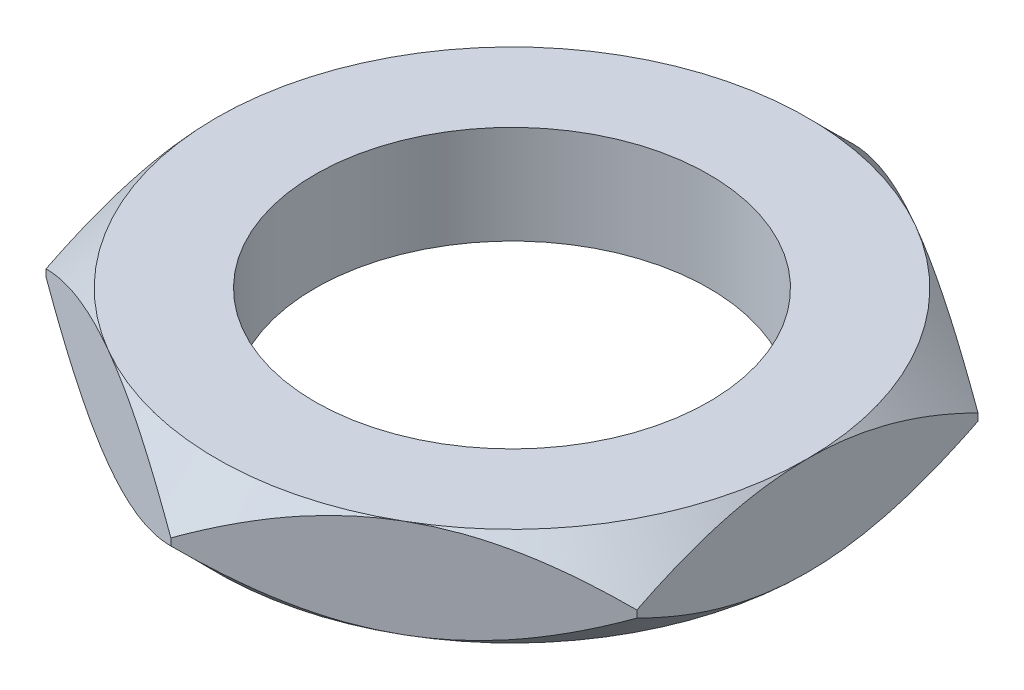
ISO-10303-21;
HEADER;
FILE_DESCRIPTION(('STEP AP214'),'2;1');
FILE_NAME('part.step','',(''),(''),'','','');
FILE_SCHEMA(('AUTOMOTIVE_DESIGN { 1 0 10303 214 1 1 1 1 }'));
ENDSEC;
DATA;
#1=APPLICATION_CONTEXT('core data for automotive mechanical design processes');
#2=APPLICATION_PROTOCOL_DEFINITION('international standard','automotive_design',2000,#1);
#3=PRODUCT_CONTEXT('',#1,'mechanical');
#4=PRODUCT('Part','Part','',(#3));
#5=PRODUCT_RELATED_PRODUCT_CATEGORY('part','',(#4));
#6=PRODUCT_DEFINITION_FORMATION('','',#4);
#7=PRODUCT_DEFINITION_CONTEXT('part definition',#1,'design');
#8=PRODUCT_DEFINITION('design','',#6,#7);
#9=PRODUCT_DEFINITION_SHAPE('','',#8);
#10=(LENGTH_UNIT() NAMED_UNIT(*) SI_UNIT(.MILLI.,.METRE.));
#11=(NAMED_UNIT(*) PLANE_ANGLE_UNIT() SI_UNIT($,.RADIAN.));
#12=(NAMED_UNIT(*) SI_UNIT($,.STERADIAN.) SOLID_ANGLE_UNIT());
#13=UNCERTAINTY_MEASURE_WITH_UNIT(LENGTH_MEASURE(1.E-05),#10,'distance_accuracy_value','');
#14=(GEOMETRIC_REPRESENTATION_CONTEXT(3) GLOBAL_UNCERTAINTY_ASSIGNED_CONTEXT((#13)) GLOBAL_UNIT_ASSIGNED_CONTEXT((#10,
#11,#12)) REPRESENTATION_CONTEXT('',''));
#15=CARTESIAN_POINT('',(0.,0.,0.));
#16=DIRECTION('',(0.,0.,1.));
#17=DIRECTION('',(1.,0.,0.));
#18=AXIS2_PLACEMENT_3D('',#15,#16,#17);
#19=CARTESIAN_POINT('',(4.49999999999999,1.5,-2.59807621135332));
#20=DIRECTION('',(-0.5,0.,0.866025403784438));
#21=DIRECTION('',(0.866025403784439,0.,0.5));
#22=AXIS2_PLACEMENT_3D('',#19,#20,#21);
#23=PLANE('',#22);
#24=CARTESIAN_POINT('',(-0.000200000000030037,0.69626789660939,-5.19626789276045));
#25=CARTESIAN_POINT('',(0.0771760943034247,0.651598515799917,-5.15159478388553));
#26=CARTESIAN_POINT('',(0.155146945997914,0.608299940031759,-5.10657829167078));
#27=CARTESIAN_POINT('',(0.31239485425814,0.52486140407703,-5.01579116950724));
#28=CARTESIAN_POINT('',(0.391672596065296,0.484723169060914,-4.97002014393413));
#29=CARTESIAN_POINT('',(0.632377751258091,0.369332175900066,-4.83104895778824));
#30=CARTESIAN_POINT('',(0.795842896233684,0.299595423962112,-4.73667231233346));
#31=CARTESIAN_POINT('',(1.12548346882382,0.180175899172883,-4.54635423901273));
#32=CARTESIAN_POINT('',(1.29157463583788,0.130192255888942,-4.45046145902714));
#33=CARTESIAN_POINT('',(1.54344209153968,0.0723733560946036,-4.30504571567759));
#34=CARTESIAN_POINT('',(1.62776873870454,0.0559675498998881,-4.25635970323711));
#35=CARTESIAN_POINT('',(1.79713606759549,0.0292460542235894,-4.15857543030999));
#36=CARTESIAN_POINT('',(1.88217664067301,0.0189294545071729,-4.10947723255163));
#37=CARTESIAN_POINT('',(2.08940607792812,0.00163236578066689,-3.98983326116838));
#38=CARTESIAN_POINT('',(2.21181821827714,-0.00199708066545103,-3.9191585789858));
#39=CARTESIAN_POINT('',(2.4564218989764,0.00409348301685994,-3.77793657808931));
#40=CARTESIAN_POINT('',(2.57861334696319,0.0138181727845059,-3.70738931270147));
#41=CARTESIAN_POINT('',(2.8218442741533,0.0460437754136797,-3.56695987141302));
#42=CARTESIAN_POINT('',(2.9428823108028,0.0685589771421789,-3.49707852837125));
#43=CARTESIAN_POINT('',(3.18287804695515,0.125141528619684,-3.35851692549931));
#44=CARTESIAN_POINT('',(3.30183590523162,0.159207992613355,-3.28983657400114));
#45=CARTESIAN_POINT('',(3.51301267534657,0.229295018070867,-3.16791360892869));
#46=CARTESIAN_POINT('',(3.60569909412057,0.263472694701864,-3.11440108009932));
#47=CARTESIAN_POINT('',(3.78940800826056,0.337335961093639,-3.00833668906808));
#48=CARTESIAN_POINT('',(3.88043045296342,0.37702171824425,-2.95578485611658));
#49=CARTESIAN_POINT('',(4.06052473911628,0.461011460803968,-2.85180737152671));
#50=CARTESIAN_POINT('',(4.14960170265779,0.505300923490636,-2.80037876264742));
#51=CARTESIAN_POINT('',(4.32610607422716,0.597916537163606,-2.6984739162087));
#52=CARTESIAN_POINT('',(4.41353445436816,0.646240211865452,-2.64799711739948));
#53=CARTESIAN_POINT('',(4.50019999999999,0.696267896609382,-2.59796074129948));
#54=B_SPLINE_CURVE_WITH_KNOTS('',3,(#24,#25,#26,#27,#28,#29,#30,#31,#32,#33,#34,#35,#36,#37,#38,
#39,#40,#41,#42,#43,#44,#45,#46,#47,#48,#49,#50,#51,#52,#53),.UNSPECIFIED.,.F.,.F.,(4,2,2,2,2,2,
2,2,2,2,2,2,2,2,4),(0.,0.299653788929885,0.599470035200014,1.20233965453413,1.79563573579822,
2.09170187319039,2.38772374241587,2.81125251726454,3.23492974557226,3.65908121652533,
4.08320017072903,4.42009140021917,4.75699287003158,5.09286208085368,5.42852662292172),.UNSPECIFIED.);
#55=CARTESIAN_POINT('',(0.,0.696152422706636,-5.19615242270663));
#56=VERTEX_POINT('',#55);
#57=CARTESIAN_POINT('',(2.24999999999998,0.,-3.89711431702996));
#58=VERTEX_POINT('',#57);
#59=EDGE_CURVE('E150',#56,#58,#54,.T.);
#60=ORIENTED_EDGE('',*,*,#59,.F.);
#61=DIRECTION('',(0.,-1.,0.));
#62=VECTOR('',#61,1.);
#63=CARTESIAN_POINT('',(0.,1.5,-5.19615242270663));
#64=LINE('',#63,#62);
#65=CARTESIAN_POINT('',(0.,0.803847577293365,-5.19615242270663));
#66=VERTEX_POINT('',#65);
#67=EDGE_CURVE('E245',#66,#56,#64,.T.);
#68=ORIENTED_EDGE('',*,*,#67,.F.);
#69=CARTESIAN_POINT('',(4.50019999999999,0.803732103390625,-2.59796074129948));
#70=CARTESIAN_POINT('',(4.42282390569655,0.848401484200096,-2.64263385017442));
#71=CARTESIAN_POINT('',(4.34485305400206,0.891700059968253,-2.68765034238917));
#72=CARTESIAN_POINT('',(4.18760514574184,0.975138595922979,-2.77843746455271));
#73=CARTESIAN_POINT('',(4.10832740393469,1.01527683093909,-2.82420849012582));
#74=CARTESIAN_POINT('',(3.8676222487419,1.13066782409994,-2.96317967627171));
#75=CARTESIAN_POINT('',(3.70415710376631,1.20040457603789,-3.05755632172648));
#76=CARTESIAN_POINT('',(3.37451653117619,1.31982410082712,-3.24787439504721));
#77=CARTESIAN_POINT('',(3.20842536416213,1.36980774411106,-3.3437671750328));
#78=CARTESIAN_POINT('',(2.95655790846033,1.42762664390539,-3.48918291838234));
#79=CARTESIAN_POINT('',(2.87223126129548,1.44403245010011,-3.53786893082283));
#80=CARTESIAN_POINT('',(2.70286393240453,1.47075394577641,-3.63565320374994));
#81=CARTESIAN_POINT('',(2.61782335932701,1.48107054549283,-3.68475140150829));
#82=CARTESIAN_POINT('',(2.41059392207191,1.49836763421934,-3.80439537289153));
#83=CARTESIAN_POINT('',(2.28818178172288,1.50199708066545,-3.87507005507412));
#84=CARTESIAN_POINT('',(2.04357810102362,1.49590651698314,-4.01629205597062));
#85=CARTESIAN_POINT('',(1.92138665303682,1.4861818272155,-4.08683932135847));
#86=CARTESIAN_POINT('',(1.67815572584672,1.45395622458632,-4.22726876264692));
#87=CARTESIAN_POINT('',(1.55711768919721,1.43144102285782,-4.2971501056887));
#88=CARTESIAN_POINT('',(1.31712195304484,1.37485847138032,-4.43571170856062));
#89=CARTESIAN_POINT('',(1.19816409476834,1.34079200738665,-4.50439206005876));
#90=CARTESIAN_POINT('',(0.986987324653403,1.27070498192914,-4.62631502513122));
#91=CARTESIAN_POINT('',(0.894300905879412,1.23652730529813,-4.67982755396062));
#92=CARTESIAN_POINT('',(0.710591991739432,1.16266403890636,-4.78589194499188));
#93=CARTESIAN_POINT('',(0.619569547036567,1.12297828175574,-4.83844377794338));
#94=CARTESIAN_POINT('',(0.439475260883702,1.03898853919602,-4.94242126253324));
#95=CARTESIAN_POINT('',(0.350398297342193,0.994699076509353,-4.99384987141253));
#96=CARTESIAN_POINT('',(0.173893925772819,0.902083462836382,-5.09575471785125));
#97=CARTESIAN_POINT('',(0.0864655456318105,0.853759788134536,-5.14623151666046));
#98=CARTESIAN_POINT('',(-0.000200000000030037,0.803732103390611,-5.19626789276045));
#99=B_SPLINE_CURVE_WITH_KNOTS('',3,(#69,#70,#71,#72,#73,#74,#75,#76,#77,#78,#79,#80,#81,#82,#83,
#84,#85,#86,#87,#88,#89,#90,#91,#92,#93,#94,#95,#96,#97,#98),.UNSPECIFIED.,.F.,.F.,(4,2,2,2,2,2,
2,2,2,2,2,2,2,2,4),(0.,0.299653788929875,0.599470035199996,1.2023396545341,1.79563573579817,
2.09170187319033,2.38772374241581,2.81125251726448,3.23492974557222,3.65908121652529,
4.083200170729,4.42009140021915,4.75699287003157,5.09286208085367,5.42852662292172),.UNSPECIFIED.);
#100=CARTESIAN_POINT('',(2.24999999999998,1.5,-3.89711431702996));
#101=VERTEX_POINT('',#100);
#102=EDGE_CURVE('E221',#101,#66,#99,.T.);
#103=ORIENTED_EDGE('',*,*,#102,.F.);
#104=CARTESIAN_POINT('',(4.49999999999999,0.803847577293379,-2.59807621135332));
#105=VERTEX_POINT('',#104);
#106=EDGE_CURVE('E226',#105,#101,#99,.T.);
#107=ORIENTED_EDGE('',*,*,#106,.F.);
#108=DIRECTION('',(0.,-1.,0.));
#109=VECTOR('',#108,1.);
#110=CARTESIAN_POINT('',(4.49999999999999,1.5,-2.59807621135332));
#111=LINE('',#110,#109);
#112=CARTESIAN_POINT('',(4.49999999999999,0.696152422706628,-2.59807621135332));
#113=VERTEX_POINT('',#112);
#114=EDGE_CURVE('E233',#105,#113,#111,.T.);
#115=ORIENTED_EDGE('',*,*,#114,.T.);
#116=EDGE_CURVE('E131',#58,#113,#54,.T.);
#117=ORIENTED_EDGE('',*,*,#116,.F.);
#118=EDGE_LOOP('',(#60,#68,#103,#107,#115,#117));
#119=FACE_BOUND('',#118,.T.);
#120=ADVANCED_FACE('F34',(#119),#23,.F.);
#121=CARTESIAN_POINT('',(0.,1.5,-5.19615242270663));
#122=DIRECTION('',(0.5,0.,0.866025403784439));
#123=DIRECTION('',(0.866025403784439,0.,-0.5));
#124=AXIS2_PLACEMENT_3D('',#121,#122,#123);
#125=PLANE('',#124);
#126=CARTESIAN_POINT('',(-4.50019999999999,0.696267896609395,-2.59796074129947));
#127=CARTESIAN_POINT('',(-4.42282390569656,0.65159851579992,-2.64263385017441));
#128=CARTESIAN_POINT('',(-4.34485305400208,0.608299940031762,-2.68765034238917));
#129=CARTESIAN_POINT('',(-4.18760514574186,0.524861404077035,-2.77843746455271));
#130=CARTESIAN_POINT('',(-4.10832740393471,0.484723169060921,-2.82420849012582));
#131=CARTESIAN_POINT('',(-3.86762224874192,0.369332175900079,-2.9631796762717));
#132=CARTESIAN_POINT('',(-3.70415710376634,0.299595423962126,-3.05755632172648));
#133=CARTESIAN_POINT('',(-3.37451653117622,0.180175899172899,-3.24787439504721));
#134=CARTESIAN_POINT('',(-3.20842536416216,0.13019225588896,-3.34376717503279));
#135=CARTESIAN_POINT('',(-2.95655790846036,0.0723733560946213,-3.48918291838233));
#136=CARTESIAN_POINT('',(-2.87223126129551,0.0559675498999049,-3.53786893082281));
#137=CARTESIAN_POINT('',(-2.70286393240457,0.0292460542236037,-3.63565320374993));
#138=CARTESIAN_POINT('',(-2.61782335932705,0.0189294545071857,-3.68475140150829));
#139=CARTESIAN_POINT('',(-2.41059392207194,0.00163236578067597,-3.80439537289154));
#140=CARTESIAN_POINT('',(-2.28818178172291,-0.0019970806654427,-3.87507005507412));
#141=CARTESIAN_POINT('',(-2.04357810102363,0.00409348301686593,-4.01629205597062));
#142=CARTESIAN_POINT('',(-1.92138665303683,0.0138181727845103,-4.08683932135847));
#143=CARTESIAN_POINT('',(-1.67815572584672,0.0460437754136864,-4.22726876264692));
#144=CARTESIAN_POINT('',(-1.55711768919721,0.0685589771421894,-4.2971501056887));
#145=CARTESIAN_POINT('',(-1.31712195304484,0.125141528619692,-4.43571170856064));
#146=CARTESIAN_POINT('',(-1.19816409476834,0.159207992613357,-4.5043920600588));
#147=CARTESIAN_POINT('',(-0.986987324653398,0.229295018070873,-4.62631502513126));
#148=CARTESIAN_POINT('',(-0.894300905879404,0.263472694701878,-4.67982755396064));
#149=CARTESIAN_POINT('',(-0.710591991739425,0.337335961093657,-4.78589194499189));
#150=CARTESIAN_POINT('',(-0.619569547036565,0.377021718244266,-4.83844377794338));
#151=CARTESIAN_POINT('',(-0.439475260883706,0.461011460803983,-4.94242126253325));
#152=CARTESIAN_POINT('',(-0.350398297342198,0.505300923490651,-4.99384987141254));
#153=CARTESIAN_POINT('',(-0.173893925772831,0.59791653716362,-5.09575471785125));
#154=CARTESIAN_POINT('',(-0.0864655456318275,0.646240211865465,-5.14623151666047));
#155=CARTESIAN_POINT('',(0.000200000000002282,0.69626789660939,-5.19626789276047));
#156=B_SPLINE_CURVE_WITH_KNOTS('',3,(#126,#127,#128,#129,#130,#131,#132,#133,#134,#135,#136,
#137,#138,#139,#140,#141,#142,#143,#144,#145,#146,#147,#148,#149,#150,#151,#152,#153,#154,#155),
.UNSPECIFIED.,.F.,.F.,(4,2,2,2,2,2,2,2,2,2,2,2,2,2,4),(0.,0.299653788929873,0.59947003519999,
1.20233965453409,1.79563573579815,2.09170187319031,2.38772374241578,2.81125251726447,
3.23492974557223,3.65908121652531,4.08320017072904,4.42009140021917,4.75699287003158,
5.09286208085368,5.42852662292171),.UNSPECIFIED.);
#157=CARTESIAN_POINT('',(-4.50000000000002,0.696152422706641,-2.59807621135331));
#158=VERTEX_POINT('',#157);
#159=CARTESIAN_POINT('',(-2.25,0.,-3.89711431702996));
#160=VERTEX_POINT('',#159);
#161=EDGE_CURVE('E193',#158,#160,#156,.T.);
#162=ORIENTED_EDGE('',*,*,#161,.F.);
#163=DIRECTION('',(0.,-1.,0.));
#164=VECTOR('',#163,1.);
#165=CARTESIAN_POINT('',(-4.50000000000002,1.5,-2.59807621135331));
#166=LINE('',#165,#164);
#167=CARTESIAN_POINT('',(-4.50000000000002,0.803847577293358,-2.59807621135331));
#168=VERTEX_POINT('',#167);
#169=EDGE_CURVE('E242',#168,#158,#166,.T.);
#170=ORIENTED_EDGE('',*,*,#169,.F.);
#171=CARTESIAN_POINT('',(0.000200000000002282,0.80373210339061,-5.19626789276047));
#172=CARTESIAN_POINT('',(-0.0771760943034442,0.848401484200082,-5.15159478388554));
#173=CARTESIAN_POINT('',(-0.155146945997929,0.89170005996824,-5.10657829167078));
#174=CARTESIAN_POINT('',(-0.31239485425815,0.975138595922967,-5.01579116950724));
#175=CARTESIAN_POINT('',(-0.391672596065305,1.01527683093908,-4.97002014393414));
#176=CARTESIAN_POINT('',(-0.632377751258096,1.13066782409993,-4.83104895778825));
#177=CARTESIAN_POINT('',(-0.795842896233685,1.20040457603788,-4.73667231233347));
#178=CARTESIAN_POINT('',(-1.12548346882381,1.31982410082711,-4.54635423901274));
#179=CARTESIAN_POINT('',(-1.29157463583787,1.36980774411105,-4.45046145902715));
#180=CARTESIAN_POINT('',(-1.54344209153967,1.42762664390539,-4.30504571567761));
#181=CARTESIAN_POINT('',(-1.62776873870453,1.4440324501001,-4.25635970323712));
#182=CARTESIAN_POINT('',(-1.79713606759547,1.4707539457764,-4.15857543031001));
#183=CARTESIAN_POINT('',(-1.882176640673,1.48107054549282,-4.10947723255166));
#184=CARTESIAN_POINT('',(-2.08940607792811,1.49836763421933,-3.98983326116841));
#185=CARTESIAN_POINT('',(-2.21181821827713,1.50199708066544,-3.91915857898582));
#186=CARTESIAN_POINT('',(-2.4564218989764,1.49590651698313,-3.77793657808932));
#187=CARTESIAN_POINT('',(-2.5786133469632,1.48618182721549,-3.70738931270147));
#188=CARTESIAN_POINT('',(-2.82184427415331,1.45395622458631,-3.56695987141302));
#189=CARTESIAN_POINT('',(-2.94288231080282,1.43144102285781,-3.49707852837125));
#190=CARTESIAN_POINT('',(-3.18287804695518,1.3748584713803,-3.35851692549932));
#191=CARTESIAN_POINT('',(-3.30183590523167,1.34079200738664,-3.28983657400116));
#192=CARTESIAN_POINT('',(-3.51301267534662,1.27070498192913,-3.16791360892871));
#193=CARTESIAN_POINT('',(-3.60569909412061,1.23652730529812,-3.11440108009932));
#194=CARTESIAN_POINT('',(-3.78940800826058,1.16266403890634,-3.00833668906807));
#195=CARTESIAN_POINT('',(-3.88043045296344,1.12297828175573,-2.95578485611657));
#196=CARTESIAN_POINT('',(-4.0605247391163,1.03898853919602,-2.85180737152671));
#197=CARTESIAN_POINT('',(-4.14960170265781,0.994699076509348,-2.80037876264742));
#198=CARTESIAN_POINT('',(-4.32610607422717,0.902083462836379,-2.6984739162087));
#199=CARTESIAN_POINT('',(-4.41353445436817,0.853759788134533,-2.64799711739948));
#200=CARTESIAN_POINT('',(-4.50019999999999,0.803732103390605,-2.59796074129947));
#201=B_SPLINE_CURVE_WITH_KNOTS('',3,(#171,#172,#173,#174,#175,#176,#177,#178,#179,#180,#181,
#182,#183,#184,#185,#186,#187,#188,#189,#190,#191,#192,#193,#194,#195,#196,#197,#198,#199,#200),
.UNSPECIFIED.,.F.,.F.,(4,2,2,2,2,2,2,2,2,2,2,2,2,2,4),(0.,0.299653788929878,0.599470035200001,
1.20233965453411,1.79563573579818,2.09170187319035,2.38772374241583,2.81125251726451,
3.23492974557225,3.65908121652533,4.08320017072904,4.42009140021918,4.75699287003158,
5.09286208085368,5.42852662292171),.UNSPECIFIED.);
#202=CARTESIAN_POINT('',(-2.25000000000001,1.5,-3.89711431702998));
#203=VERTEX_POINT('',#202);
#204=EDGE_CURVE('E208',#203,#168,#201,.T.);
#205=ORIENTED_EDGE('',*,*,#204,.F.);
#206=EDGE_CURVE('E214',#66,#203,#201,.T.);
#207=ORIENTED_EDGE('',*,*,#206,.F.);
#208=ORIENTED_EDGE('',*,*,#67,.T.);
#209=EDGE_CURVE('E151',#160,#56,#156,.T.);
#210=ORIENTED_EDGE('',*,*,#209,.F.);
#211=EDGE_LOOP('',(#162,#170,#205,#207,#208,#210));
#212=FACE_BOUND('',#211,.T.);
#213=ADVANCED_FACE('F200',(#212),#125,.F.);
#214=CARTESIAN_POINT('',(-4.50000000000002,1.5,-2.59807621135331));
#215=DIRECTION('',(1.,0.,0.));
#216=DIRECTION('',(0.,0.,-1.));
#217=AXIS2_PLACEMENT_3D('',#214,#215,#216);
#218=PLANE('',#217);
#219=CARTESIAN_POINT('',(-4.50000000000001,3.46036408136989,-6.56638380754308));
#220=CARTESIAN_POINT('',(-4.50000000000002,3.32407212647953,-6.40111667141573));
#221=CARTESIAN_POINT('',(-4.50000000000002,3.18871360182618,-6.23506760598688));
#222=CARTESIAN_POINT('',(-4.50000000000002,2.92036250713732,-5.90100181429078));
#223=CARTESIAN_POINT('',(-4.50000000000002,2.78737054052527,-5.73298460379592));
#224=CARTESIAN_POINT('',(-4.50000000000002,2.52286788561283,-5.39279287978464));
#225=CARTESIAN_POINT('',(-4.50000000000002,2.39138978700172,-5.22059294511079));
#226=CARTESIAN_POINT('',(-4.50000000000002,2.13222901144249,-4.87337879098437));
#227=CARTESIAN_POINT('',(-4.50000000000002,2.00454596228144,-4.69836485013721));
#228=CARTESIAN_POINT('',(-4.50000000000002,1.74186715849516,-4.32777489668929));
#229=CARTESIAN_POINT('',(-4.50000000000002,1.60736146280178,-4.13184955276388));
#230=CARTESIAN_POINT('',(-4.50000000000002,1.34605070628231,-3.73479283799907));
#231=CARTESIAN_POINT('',(-4.50000000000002,1.21924825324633,-3.53365973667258));
#232=CARTESIAN_POINT('',(-4.50000000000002,0.976783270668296,-3.12600408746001));
#233=CARTESIAN_POINT('',(-4.50000000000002,0.861071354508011,-2.9195111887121));
#234=CARTESIAN_POINT('',(-4.50000000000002,0.644220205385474,-2.49908187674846));
#235=CARTESIAN_POINT('',(-4.50000000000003,0.543068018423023,-2.28515229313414));
#236=CARTESIAN_POINT('',(-4.50000000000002,0.387940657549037,-1.91347041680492));
#237=CARTESIAN_POINT('',(-4.50000000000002,0.328868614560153,-1.75786085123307));
#238=CARTESIAN_POINT('',(-4.50000000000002,0.223173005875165,-1.44237337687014));
#239=CARTESIAN_POINT('',(-4.50000000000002,0.176551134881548,-1.28249489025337));
#240=CARTESIAN_POINT('',(-4.50000000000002,0.0992715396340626,-0.962700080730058));
#241=CARTESIAN_POINT('',(-4.50000000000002,0.068275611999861,-0.802866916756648));
#242=CARTESIAN_POINT('',(-4.50000000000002,0.0228151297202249,-0.480850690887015));
#243=CARTESIAN_POINT('',(-4.50000000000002,0.00834644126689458,-0.318668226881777));
#244=CARTESIAN_POINT('',(-4.50000000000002,-0.00261949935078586,-0.00257242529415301));
#245=CARTESIAN_POINT('',(-4.50000000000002,-5.586362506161E-05,0.151308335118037));
#246=CARTESIAN_POINT('',(-4.50000000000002,0.0206581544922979,0.458007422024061));
#247=CARTESIAN_POINT('',(-4.50000000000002,0.0388095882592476,0.610825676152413));
#248=CARTESIAN_POINT('',(-4.50000000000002,0.0899440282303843,0.916967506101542));
#249=CARTESIAN_POINT('',(-4.50000000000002,0.123208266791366,1.07024324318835));
#250=CARTESIAN_POINT('',(-4.50000000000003,0.202625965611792,1.37335740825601));
#251=CARTESIAN_POINT('',(-4.50000000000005,0.248779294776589,1.52319587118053));
#252=CARTESIAN_POINT('',(-4.50000000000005,0.352721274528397,1.82177349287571));
#253=CARTESIAN_POINT('',(-4.50000000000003,0.410705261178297,1.97044375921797));
#254=CARTESIAN_POINT('',(-4.50000000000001,0.535671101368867,2.26398687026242));
#255=CARTESIAN_POINT('',(-4.50000000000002,0.602656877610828,2.40885802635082));
#256=CARTESIAN_POINT('',(-4.50000000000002,0.74403938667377,2.69546599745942));
#257=CARTESIAN_POINT('',(-4.50000000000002,0.818458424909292,2.83719171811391));
#258=CARTESIAN_POINT('',(-4.50000000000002,0.973076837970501,3.11740594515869));
#259=CARTESIAN_POINT('',(-4.50000000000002,1.0532753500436,3.25589493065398));
#260=CARTESIAN_POINT('',(-4.50000000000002,1.21425040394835,3.52327657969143));
#261=CARTESIAN_POINT('',(-4.50000000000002,1.29480234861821,3.65230518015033));
#262=CARTESIAN_POINT('',(-4.50000000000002,1.45936331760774,3.90814523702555));
#263=CARTESIAN_POINT('',(-4.50000000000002,1.54337259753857,4.03495652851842));
#264=CARTESIAN_POINT('',(-4.50000000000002,1.71355874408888,4.28564238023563));
#265=CARTESIAN_POINT('',(-4.50000000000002,1.79971313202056,4.40953225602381));
#266=CARTESIAN_POINT('',(-4.50000000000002,1.97435335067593,4.65560836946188));
#267=CARTESIAN_POINT('',(-4.50000000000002,2.0628385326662,4.77779506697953));
#268=CARTESIAN_POINT('',(-4.50000000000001,2.15227861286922,4.89926634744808));
#269=B_SPLINE_CURVE_WITH_KNOTS('',3,(#219,#220,#221,#222,#223,#224,#225,#226,#227,#228,#229,
#230,#231,#232,#233,#234,#235,#236,#237,#238,#239,#240,#241,#242,#243,#244,#245,#246,#247,#248,
#249,#250,#251,#252,#253,#254,#255,#256,#257,#258,#259,#260,#261,#262,#263,#264,#265,#266,#267,
#268),.UNSPECIFIED.,.F.,.F.,(4,2,2,2,2,2,2,2,2,2,2,2,2,2,2,2,2,2,2,2,2,2,2,2,4),(0.,
0.642660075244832,1.2854817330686,1.93540408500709,2.58526248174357,3.29808343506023,
4.01114437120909,4.72086610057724,5.42995242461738,5.92887229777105,6.42786004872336,
6.91552650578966,7.40307096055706,7.86396558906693,8.32489130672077,8.79476979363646,
9.26464350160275,9.74301518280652,10.2215960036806,10.7016587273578,11.1816499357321,
11.6379109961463,12.0942058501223,12.5468813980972,12.9994322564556),.UNSPECIFIED.);
#270=CARTESIAN_POINT('',(-4.50000000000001,0.696152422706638,2.59807621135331));
#271=VERTEX_POINT('',#270);
#272=CARTESIAN_POINT('',(-4.50000000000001,0.,0.));
#273=VERTEX_POINT('',#272);
#274=EDGE_CURVE('E337',#271,#273,#269,.F.);
#275=ORIENTED_EDGE('',*,*,#274,.F.);
#276=DIRECTION('',(0.,-1.,0.));
#277=VECTOR('',#276,1.);
#278=CARTESIAN_POINT('',(-4.50000000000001,1.5,2.59807621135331));
#279=LINE('',#278,#277);
#280=CARTESIAN_POINT('',(-4.50000000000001,0.803847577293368,2.59807621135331));
#281=VERTEX_POINT('',#280);
#282=EDGE_CURVE('E239',#281,#271,#279,.T.);
#283=ORIENTED_EDGE('',*,*,#282,.F.);
#284=CARTESIAN_POINT('',(-4.50000000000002,-1.96036408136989,-6.56638380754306));
#285=CARTESIAN_POINT('',(-4.50000000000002,-1.82407212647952,-6.40111667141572));
#286=CARTESIAN_POINT('',(-4.50000000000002,-1.68871360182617,-6.23506760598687));
#287=CARTESIAN_POINT('',(-4.50000000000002,-1.42036250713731,-5.90100181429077));
#288=CARTESIAN_POINT('',(-4.50000000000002,-1.28737054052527,-5.73298460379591));
#289=CARTESIAN_POINT('',(-4.50000000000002,-1.02286788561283,-5.39279287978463));
#290=CARTESIAN_POINT('',(-4.50000000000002,-0.891389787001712,-5.22059294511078));
#291=CARTESIAN_POINT('',(-4.50000000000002,-0.632229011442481,-4.87337879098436));
#292=CARTESIAN_POINT('',(-4.50000000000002,-0.504545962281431,-4.6983648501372));
#293=CARTESIAN_POINT('',(-4.50000000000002,-0.241867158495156,-4.32777489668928));
#294=CARTESIAN_POINT('',(-4.50000000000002,-0.107361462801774,-4.13184955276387));
#295=CARTESIAN_POINT('',(-4.50000000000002,0.153949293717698,-3.73479283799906));
#296=CARTESIAN_POINT('',(-4.50000000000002,0.280751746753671,-3.53365973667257));
#297=CARTESIAN_POINT('',(-4.50000000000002,0.523216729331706,-3.12600408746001));
#298=CARTESIAN_POINT('',(-4.50000000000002,0.63892864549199,-2.9195111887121));
#299=CARTESIAN_POINT('',(-4.50000000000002,0.855779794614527,-2.49908187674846));
#300=CARTESIAN_POINT('',(-4.50000000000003,0.956931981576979,-2.28515229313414));
#301=CARTESIAN_POINT('',(-4.50000000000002,1.11205934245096,-1.91347041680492));
#302=CARTESIAN_POINT('',(-4.50000000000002,1.17113138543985,-1.75786085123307));
#303=CARTESIAN_POINT('',(-4.50000000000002,1.27682699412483,-1.44237337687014));
#304=CARTESIAN_POINT('',(-4.50000000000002,1.32344886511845,-1.28249489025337));
#305=CARTESIAN_POINT('',(-4.50000000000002,1.40072846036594,-0.962700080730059));
#306=CARTESIAN_POINT('',(-4.50000000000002,1.43172438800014,-0.802866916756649));
#307=CARTESIAN_POINT('',(-4.50000000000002,1.47718487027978,-0.480850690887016));
#308=CARTESIAN_POINT('',(-4.50000000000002,1.49165355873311,-0.318668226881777));
#309=CARTESIAN_POINT('',(-4.50000000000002,1.50261949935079,-0.00257242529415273));
#310=CARTESIAN_POINT('',(-4.50000000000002,1.50005586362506,0.151308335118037));
#311=CARTESIAN_POINT('',(-4.50000000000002,1.4793418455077,0.458007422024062));
#312=CARTESIAN_POINT('',(-4.50000000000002,1.46119041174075,0.610825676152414));
#313=CARTESIAN_POINT('',(-4.50000000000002,1.41005597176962,0.916967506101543));
#314=CARTESIAN_POINT('',(-4.50000000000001,1.37679173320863,1.07024324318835));
#315=CARTESIAN_POINT('',(-4.50000000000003,1.29737403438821,1.37335740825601));
#316=CARTESIAN_POINT('',(-4.50000000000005,1.25122070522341,1.52319587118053));
#317=CARTESIAN_POINT('',(-4.50000000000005,1.1472787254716,1.82177349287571));
#318=CARTESIAN_POINT('',(-4.50000000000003,1.0892947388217,1.97044375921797));
#319=CARTESIAN_POINT('',(-4.50000000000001,0.964328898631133,2.26398687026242));
#320=CARTESIAN_POINT('',(-4.50000000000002,0.897343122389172,2.40885802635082));
#321=CARTESIAN_POINT('',(-4.50000000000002,0.755960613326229,2.69546599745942));
#322=CARTESIAN_POINT('',(-4.50000000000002,0.681541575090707,2.83719171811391));
#323=CARTESIAN_POINT('',(-4.50000000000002,0.526923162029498,3.11740594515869));
#324=CARTESIAN_POINT('',(-4.50000000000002,0.446724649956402,3.25589493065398));
#325=CARTESIAN_POINT('',(-4.50000000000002,0.285749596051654,3.52327657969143));
#326=CARTESIAN_POINT('',(-4.50000000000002,0.20519765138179,3.65230518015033));
#327=CARTESIAN_POINT('',(-4.50000000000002,0.0406366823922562,3.90814523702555));
#328=CARTESIAN_POINT('',(-4.50000000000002,-0.0433725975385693,4.03495652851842));
#329=CARTESIAN_POINT('',(-4.50000000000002,-0.213558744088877,4.28564238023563));
#330=CARTESIAN_POINT('',(-4.50000000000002,-0.299713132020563,4.40953225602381));
#331=CARTESIAN_POINT('',(-4.50000000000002,-0.474353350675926,4.65560836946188));
#332=CARTESIAN_POINT('',(-4.50000000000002,-0.5628385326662,4.77779506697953));
#333=CARTESIAN_POINT('',(-4.50000000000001,-0.652278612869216,4.89926634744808));
#334=B_SPLINE_CURVE_WITH_KNOTS('',3,(#284,#285,#286,#287,#288,#289,#290,#291,#292,#293,#294,
#295,#296,#297,#298,#299,#300,#301,#302,#303,#304,#305,#306,#307,#308,#309,#310,#311,#312,#313,
#314,#315,#316,#317,#318,#319,#320,#321,#322,#323,#324,#325,#326,#327,#328,#329,#330,#331,#332,
#333),.UNSPECIFIED.,.F.,.F.,(4,2,2,2,2,2,2,2,2,2,2,2,2,2,2,2,2,2,2,2,2,2,2,2,4),(0.,
0.642660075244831,1.2854817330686,1.93540408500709,2.58526248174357,3.29808343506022,
4.01114437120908,4.72086610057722,5.42995242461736,5.92887229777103,6.42786004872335,
6.91552650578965,7.40307096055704,7.86396558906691,8.32489130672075,8.79476979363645,
9.26464350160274,9.74301518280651,10.2215960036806,10.7016587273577,11.1816499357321,
11.6379109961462,12.0942058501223,12.5468813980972,12.9994322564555),.UNSPECIFIED.);
#335=CARTESIAN_POINT('',(-4.50000000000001,1.5,0.));
#336=VERTEX_POINT('',#335);
#337=EDGE_CURVE('E216',#336,#281,#334,.T.);
#338=ORIENTED_EDGE('',*,*,#337,.F.);
#339=EDGE_CURVE('E215',#168,#336,#334,.T.);
#340=ORIENTED_EDGE('',*,*,#339,.F.);
#341=ORIENTED_EDGE('',*,*,#169,.T.);
#342=EDGE_CURVE('E194',#273,#158,#269,.F.);
#343=ORIENTED_EDGE('',*,*,#342,.F.);
#344=EDGE_LOOP('',(#275,#283,#338,#340,#341,#343));
#345=FACE_BOUND('',#344,.T.);
#346=ADVANCED_FACE('F203',(#345),#218,.F.);
#347=CARTESIAN_POINT('',(-4.50000000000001,1.5,2.59807621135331));
#348=DIRECTION('',(0.5,0.,-0.866025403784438));
#349=DIRECTION('',(-0.866025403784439,0.,-0.5));
#350=AXIS2_PLACEMENT_3D('',#347,#348,#349);
#351=PLANE('',#350);
#352=CARTESIAN_POINT('',(0.000199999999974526,0.696267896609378,5.19626789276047));
#353=CARTESIAN_POINT('',(-0.0771760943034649,0.651598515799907,5.15159478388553));
#354=CARTESIAN_POINT('',(-0.155146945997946,0.60829994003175,5.10657829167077));
#355=CARTESIAN_POINT('',(-0.312394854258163,0.524861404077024,5.01579116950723));
#356=CARTESIAN_POINT('',(-0.391672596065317,0.48472316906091,4.97002014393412));
#357=CARTESIAN_POINT('',(-0.632377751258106,0.369332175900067,4.83104895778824));
#358=CARTESIAN_POINT('',(-0.795842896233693,0.299595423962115,4.73667231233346));
#359=CARTESIAN_POINT('',(-1.12548346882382,0.180175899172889,4.54635423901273));
#360=CARTESIAN_POINT('',(-1.29157463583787,0.130192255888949,4.45046145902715));
#361=CARTESIAN_POINT('',(-1.54344209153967,0.0723733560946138,4.30504571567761));
#362=CARTESIAN_POINT('',(-1.62776873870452,0.0559675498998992,4.25635970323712));
#363=CARTESIAN_POINT('',(-1.79713606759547,0.029246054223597,4.15857543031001));
#364=CARTESIAN_POINT('',(-1.88217664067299,0.018929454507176,4.10947723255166));
#365=CARTESIAN_POINT('',(-2.0894060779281,0.0016323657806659,3.98983326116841));
#366=CARTESIAN_POINT('',(-2.21181821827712,-0.00199708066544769,3.91915857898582));
#367=CARTESIAN_POINT('',(-2.45642189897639,0.00409348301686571,3.77793657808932));
#368=CARTESIAN_POINT('',(-2.57861334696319,0.0138181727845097,3.70738931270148));
#369=CARTESIAN_POINT('',(-2.8218442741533,0.0460437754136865,3.56695987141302));
#370=CARTESIAN_POINT('',(-2.94288231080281,0.0685589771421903,3.49707852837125));
#371=CARTESIAN_POINT('',(-3.18287804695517,0.125141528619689,3.35851692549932));
#372=CARTESIAN_POINT('',(-3.30183590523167,0.159207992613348,3.28983657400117));
#373=CARTESIAN_POINT('',(-3.51301267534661,0.229295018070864,3.16791360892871));
#374=CARTESIAN_POINT('',(-3.6056990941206,0.263472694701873,3.11440108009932));
#375=CARTESIAN_POINT('',(-3.78940800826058,0.337335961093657,3.00833668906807));
#376=CARTESIAN_POINT('',(-3.88043045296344,0.377021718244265,2.95578485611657));
#377=CARTESIAN_POINT('',(-4.0605247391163,0.461011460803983,2.8518073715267));
#378=CARTESIAN_POINT('',(-4.14960170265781,0.505300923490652,2.80037876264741));
#379=CARTESIAN_POINT('',(-4.32610607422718,0.597916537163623,2.6984739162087));
#380=CARTESIAN_POINT('',(-4.41353445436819,0.646240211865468,2.64799711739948));
#381=CARTESIAN_POINT('',(-4.50020000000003,0.696267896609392,2.59796074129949));
#382=B_SPLINE_CURVE_WITH_KNOTS('',3,(#352,#353,#354,#355,#356,#357,#358,#359,#360,#361,#362,
#363,#364,#365,#366,#367,#368,#369,#370,#371,#372,#373,#374,#375,#376,#377,#378,#379,#380,#381),
.UNSPECIFIED.,.F.,.F.,(4,2,2,2,2,2,2,2,2,2,2,2,2,2,4),(0.,0.299653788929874,0.599470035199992,
1.20233965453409,1.79563573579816,2.09170187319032,2.3877237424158,2.81125251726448,
3.23492974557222,3.6590812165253,4.08320017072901,4.42009140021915,4.75699287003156,
5.09286208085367,5.4285266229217),.UNSPECIFIED.);
#383=CARTESIAN_POINT('',(0.,0.696152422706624,5.19615242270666));
#384=VERTEX_POINT('',#383);
#385=CARTESIAN_POINT('',(-2.25000000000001,0.,3.89711431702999));
#386=VERTEX_POINT('',#385);
#387=EDGE_CURVE('E139',#384,#386,#382,.T.);
#388=ORIENTED_EDGE('',*,*,#387,.F.);
#389=DIRECTION('',(0.,-1.,0.));
#390=VECTOR('',#389,1.);
#391=CARTESIAN_POINT('',(0.,1.5,5.19615242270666));
#392=LINE('',#391,#390);
#393=CARTESIAN_POINT('',(0.,0.803847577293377,5.19615242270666));
#394=VERTEX_POINT('',#393);
#395=EDGE_CURVE('E149',#394,#384,#392,.T.);
#396=ORIENTED_EDGE('',*,*,#395,.F.);
#397=CARTESIAN_POINT('',(-4.50020000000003,0.803732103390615,2.59796074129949));
#398=CARTESIAN_POINT('',(-4.42282390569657,0.848401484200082,2.64263385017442));
#399=CARTESIAN_POINT('',(-4.34485305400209,0.891700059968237,2.68765034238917));
#400=CARTESIAN_POINT('',(-4.18760514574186,0.975138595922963,2.77843746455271));
#401=CARTESIAN_POINT('',(-4.10832740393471,1.01527683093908,2.82420849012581));
#402=CARTESIAN_POINT('',(-3.86762224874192,1.13066782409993,2.9631796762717));
#403=CARTESIAN_POINT('',(-3.70415710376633,1.20040457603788,3.05755632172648));
#404=CARTESIAN_POINT('',(-3.3745165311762,1.31982410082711,3.24787439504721));
#405=CARTESIAN_POINT('',(-3.20842536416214,1.36980774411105,3.3437671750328));
#406=CARTESIAN_POINT('',(-2.95655790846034,1.42762664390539,3.48918291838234));
#407=CARTESIAN_POINT('',(-2.87223126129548,1.4440324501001,3.53786893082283));
#408=CARTESIAN_POINT('',(-2.70286393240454,1.4707539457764,3.63565320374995));
#409=CARTESIAN_POINT('',(-2.61782335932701,1.48107054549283,3.68475140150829));
#410=CARTESIAN_POINT('',(-2.4105939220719,1.49836763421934,3.80439537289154));
#411=CARTESIAN_POINT('',(-2.28818178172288,1.50199708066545,3.87507005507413));
#412=CARTESIAN_POINT('',(-2.04357810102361,1.49590651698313,4.01629205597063));
#413=CARTESIAN_POINT('',(-1.92138665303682,1.48618182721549,4.08683932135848));
#414=CARTESIAN_POINT('',(-1.67815572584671,1.45395622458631,4.22726876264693));
#415=CARTESIAN_POINT('',(-1.5571176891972,1.43144102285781,4.29715010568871));
#416=CARTESIAN_POINT('',(-1.31712195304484,1.37485847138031,4.43571170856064));
#417=CARTESIAN_POINT('',(-1.19816409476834,1.34079200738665,4.50439206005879));
#418=CARTESIAN_POINT('',(-0.986987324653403,1.27070498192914,4.62631502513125));
#419=CARTESIAN_POINT('',(-0.894300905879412,1.23652730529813,4.67982755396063));
#420=CARTESIAN_POINT('',(-0.710591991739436,1.16266403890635,4.78589194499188));
#421=CARTESIAN_POINT('',(-0.619569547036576,1.12297828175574,4.83844377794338));
#422=CARTESIAN_POINT('',(-0.439475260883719,1.03898853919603,4.94242126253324));
#423=CARTESIAN_POINT('',(-0.350398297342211,0.994699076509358,4.99384987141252));
#424=CARTESIAN_POINT('',(-0.173893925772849,0.90208346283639,5.09575471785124));
#425=CARTESIAN_POINT('',(-0.086465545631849,0.853759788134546,5.14623151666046));
#426=CARTESIAN_POINT('',(0.000199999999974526,0.803732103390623,5.19626789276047));
#427=B_SPLINE_CURVE_WITH_KNOTS('',3,(#397,#398,#399,#400,#401,#402,#403,#404,#405,#406,#407,
#408,#409,#410,#411,#412,#413,#414,#415,#416,#417,#418,#419,#420,#421,#422,#423,#424,#425,#426),
.UNSPECIFIED.,.F.,.F.,(4,2,2,2,2,2,2,2,2,2,2,2,2,2,4),(0.,0.299653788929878,0.599470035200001,
1.20233965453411,1.79563573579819,2.09170187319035,2.38772374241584,2.81125251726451,
3.23492974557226,3.65908121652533,4.08320017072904,4.42009140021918,4.75699287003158,
5.09286208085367,5.4285266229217),.UNSPECIFIED.);
#428=CARTESIAN_POINT('',(-2.25000000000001,1.5,3.89711431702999));
#429=VERTEX_POINT('',#428);
#430=EDGE_CURVE('E318',#429,#394,#427,.T.);
#431=ORIENTED_EDGE('',*,*,#430,.F.);
#432=EDGE_CURVE('E322',#281,#429,#427,.T.);
#433=ORIENTED_EDGE('',*,*,#432,.F.);
#434=ORIENTED_EDGE('',*,*,#282,.T.);
#435=EDGE_CURVE('E153',#386,#271,#382,.T.);
#436=ORIENTED_EDGE('',*,*,#435,.F.);
#437=EDGE_LOOP('',(#388,#396,#431,#433,#434,#436));
#438=FACE_BOUND('',#437,.T.);
#439=ADVANCED_FACE('F323',(#438),#351,.F.);
#440=CARTESIAN_POINT('',(0.,1.5,5.19615242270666));
#441=DIRECTION('',(-0.5,0.,-0.866025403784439));
#442=DIRECTION('',(-0.866025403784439,0.,0.5));
#443=AXIS2_PLACEMENT_3D('',#440,#441,#442);
#444=PLANE('',#443);
#445=CARTESIAN_POINT('',(4.50019999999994,0.696267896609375,2.59796074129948));
#446=CARTESIAN_POINT('',(4.42282390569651,0.651598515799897,2.64263385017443));
#447=CARTESIAN_POINT('',(4.34485305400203,0.608299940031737,2.68765034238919));
#448=CARTESIAN_POINT('',(4.18760514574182,0.52486140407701,2.77843746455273));
#449=CARTESIAN_POINT('',(4.10832740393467,0.484723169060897,2.82420849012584));
#450=CARTESIAN_POINT('',(3.86762224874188,0.369332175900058,2.96317967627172));
#451=CARTESIAN_POINT('',(3.7041571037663,0.299595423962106,3.0575563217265));
#452=CARTESIAN_POINT('',(3.37451653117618,0.180175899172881,3.24787439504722));
#453=CARTESIAN_POINT('',(3.20842536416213,0.130192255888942,3.34376717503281));
#454=CARTESIAN_POINT('',(2.95655790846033,0.0723733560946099,3.48918291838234));
#455=CARTESIAN_POINT('',(2.87223126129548,0.0559675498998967,3.53786893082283));
#456=CARTESIAN_POINT('',(2.70286393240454,0.0292460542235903,3.63565320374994));
#457=CARTESIAN_POINT('',(2.61782335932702,0.0189294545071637,3.6847514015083));
#458=CARTESIAN_POINT('',(2.41059392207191,0.00163236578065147,3.80439537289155));
#459=CARTESIAN_POINT('',(2.28818178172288,-0.00199708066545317,3.87507005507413));
#460=CARTESIAN_POINT('',(2.0435781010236,0.00409348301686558,4.01629205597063));
#461=CARTESIAN_POINT('',(1.9213866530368,0.0138181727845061,4.08683932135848));
#462=CARTESIAN_POINT('',(1.67815572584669,0.046043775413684,4.22726876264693));
#463=CARTESIAN_POINT('',(1.55711768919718,0.0685589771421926,4.29715010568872));
#464=CARTESIAN_POINT('',(1.31712195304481,0.125141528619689,4.43571170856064));
#465=CARTESIAN_POINT('',(1.1981640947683,0.159207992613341,4.50439206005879));
#466=CARTESIAN_POINT('',(0.986987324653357,0.229295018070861,4.62631502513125));
#467=CARTESIAN_POINT('',(0.894300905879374,0.263472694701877,4.67982755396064));
#468=CARTESIAN_POINT('',(0.710591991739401,0.337335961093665,4.7858919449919));
#469=CARTESIAN_POINT('',(0.619569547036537,0.377021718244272,4.83844377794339));
#470=CARTESIAN_POINT('',(0.439475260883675,0.46101146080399,4.94242126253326));
#471=CARTESIAN_POINT('',(0.350398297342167,0.505300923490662,4.99384987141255));
#472=CARTESIAN_POINT('',(0.173893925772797,0.597916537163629,5.09575471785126));
#473=CARTESIAN_POINT('',(0.0864655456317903,0.646240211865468,5.14623151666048));
#474=CARTESIAN_POINT('',(-0.000200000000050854,0.696267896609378,5.19626789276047));
#475=B_SPLINE_CURVE_WITH_KNOTS('',3,(#445,#446,#447,#448,#449,#450,#451,#452,#453,#454,#455,
#456,#457,#458,#459,#460,#461,#462,#463,#464,#465,#466,#467,#468,#469,#470,#471,#472,#473,#474),
.UNSPECIFIED.,.F.,.F.,(4,2,2,2,2,2,2,2,2,2,2,2,2,2,4),(0.,0.299653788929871,0.599470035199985,
1.20233965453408,1.79563573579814,2.09170187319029,2.38772374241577,2.81125251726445,
3.23492974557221,3.65908121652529,4.08320017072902,4.42009140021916,4.75699287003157,
5.09286208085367,5.4285266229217),.UNSPECIFIED.);
#476=CARTESIAN_POINT('',(4.49999999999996,0.696152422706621,2.59807621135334));
#477=VERTEX_POINT('',#476);
#478=CARTESIAN_POINT('',(2.24999999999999,0.,3.89711431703));
#479=VERTEX_POINT('',#478);
#480=EDGE_CURVE('E122',#477,#479,#475,.T.);
#481=ORIENTED_EDGE('',*,*,#480,.F.);
#482=DIRECTION('',(0.,-1.,0.));
#483=VECTOR('',#482,1.);
#484=CARTESIAN_POINT('',(4.49999999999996,1.5,2.59807621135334));
#485=LINE('',#484,#483);
#486=CARTESIAN_POINT('',(4.49999999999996,0.803847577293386,2.59807621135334));
#487=VERTEX_POINT('',#486);
#488=EDGE_CURVE('E236',#487,#477,#485,.T.);
#489=ORIENTED_EDGE('',*,*,#488,.F.);
#490=CARTESIAN_POINT('',(-0.000200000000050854,0.803732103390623,5.19626789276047));
#491=CARTESIAN_POINT('',(0.0771760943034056,0.84840148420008,5.15159478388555));
#492=CARTESIAN_POINT('',(0.155146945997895,0.891700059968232,5.1065782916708));
#493=CARTESIAN_POINT('',(0.31239485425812,0.975138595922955,5.01579116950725));
#494=CARTESIAN_POINT('',(0.391672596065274,1.01527683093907,4.97002014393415));
#495=CARTESIAN_POINT('',(0.632377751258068,1.13066782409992,4.83104895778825));
#496=CARTESIAN_POINT('',(0.79584289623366,1.20040457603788,4.73667231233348));
#497=CARTESIAN_POINT('',(1.12548346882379,1.31982410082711,4.54635423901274));
#498=CARTESIAN_POINT('',(1.29157463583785,1.36980774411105,4.45046145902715));
#499=CARTESIAN_POINT('',(1.54344209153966,1.42762664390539,4.30504571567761));
#500=CARTESIAN_POINT('',(1.62776873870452,1.4440324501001,4.25635970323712));
#501=CARTESIAN_POINT('',(1.79713606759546,1.47075394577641,4.15857543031));
#502=CARTESIAN_POINT('',(1.88217664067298,1.48107054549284,4.10947723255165));
#503=CARTESIAN_POINT('',(2.08940607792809,1.49836763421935,3.9898332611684));
#504=CARTESIAN_POINT('',(2.21181821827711,1.50199708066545,3.91915857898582));
#505=CARTESIAN_POINT('',(2.45642189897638,1.49590651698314,3.77793657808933));
#506=CARTESIAN_POINT('',(2.57861334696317,1.48618182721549,3.70738931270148));
#507=CARTESIAN_POINT('',(2.82184427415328,1.45395622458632,3.56695987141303));
#508=CARTESIAN_POINT('',(2.94288231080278,1.43144102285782,3.49707852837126));
#509=CARTESIAN_POINT('',(3.18287804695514,1.37485847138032,3.35851692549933));
#510=CARTESIAN_POINT('',(3.30183590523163,1.34079200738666,3.28983657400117));
#511=CARTESIAN_POINT('',(3.51301267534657,1.27070498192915,3.16791360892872));
#512=CARTESIAN_POINT('',(3.60569909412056,1.23652730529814,3.11440108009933));
#513=CARTESIAN_POINT('',(3.78940800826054,1.16266403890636,3.00833668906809));
#514=CARTESIAN_POINT('',(3.8804304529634,1.12297828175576,2.95578485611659));
#515=CARTESIAN_POINT('',(4.06052473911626,1.03898853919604,2.85180737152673));
#516=CARTESIAN_POINT('',(4.14960170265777,0.994699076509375,2.80037876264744));
#517=CARTESIAN_POINT('',(4.32610607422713,0.902083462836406,2.69847391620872));
#518=CARTESIAN_POINT('',(4.41353445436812,0.85375978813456,2.6479971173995));
#519=CARTESIAN_POINT('',(4.50019999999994,0.803732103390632,2.59796074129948));
#520=B_SPLINE_CURVE_WITH_KNOTS('',3,(#490,#491,#492,#493,#494,#495,#496,#497,#498,#499,#500,
#501,#502,#503,#504,#505,#506,#507,#508,#509,#510,#511,#512,#513,#514,#515,#516,#517,#518,#519),
.UNSPECIFIED.,.F.,.F.,(4,2,2,2,2,2,2,2,2,2,2,2,2,2,4),(0.,0.29965378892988,0.599470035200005,
1.20233965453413,1.79563573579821,2.09170187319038,2.38772374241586,2.81125251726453,
3.23492974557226,3.65908121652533,4.08320017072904,4.42009140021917,4.75699287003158,
5.09286208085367,5.4285266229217),.UNSPECIFIED.);
#521=CARTESIAN_POINT('',(2.24999999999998,1.5,3.89711431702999));
#522=VERTEX_POINT('',#521);
#523=EDGE_CURVE('E312',#522,#487,#520,.T.);
#524=ORIENTED_EDGE('',*,*,#523,.F.);
#525=EDGE_CURVE('E317',#394,#522,#520,.T.);
#526=ORIENTED_EDGE('',*,*,#525,.F.);
#527=ORIENTED_EDGE('',*,*,#395,.T.);
#528=EDGE_CURVE('E134',#479,#384,#475,.T.);
#529=ORIENTED_EDGE('',*,*,#528,.F.);
#530=EDGE_LOOP('',(#481,#489,#524,#526,#527,#529));
#531=FACE_BOUND('',#530,.T.);
#532=ADVANCED_FACE('F146',(#531),#444,.F.);
#533=CARTESIAN_POINT('',(4.49999999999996,1.5,2.59807621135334));
#534=DIRECTION('',(-1.,0.,0.));
#535=DIRECTION('',(0.,0.,1.));
#536=AXIS2_PLACEMENT_3D('',#533,#534,#535);
#537=PLANE('',#536);
#538=CARTESIAN_POINT('',(4.49999999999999,3.46036408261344,-6.56638380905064));
#539=CARTESIAN_POINT('',(4.49999999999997,3.32407212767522,-6.40111667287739));
#540=CARTESIAN_POINT('',(4.49999999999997,3.18871360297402,-6.23506760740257));
#541=CARTESIAN_POINT('',(4.49999999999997,2.92036250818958,-5.90100181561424));
#542=CARTESIAN_POINT('',(4.49999999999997,2.78737054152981,-5.73298460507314));
#543=CARTESIAN_POINT('',(4.49999999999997,2.52286788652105,-5.39279288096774));
#544=CARTESIAN_POINT('',(4.49999999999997,2.39138978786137,-5.22059294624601));
#545=CARTESIAN_POINT('',(4.49999999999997,2.13222901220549,-4.87337879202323));
#546=CARTESIAN_POINT('',(4.49999999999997,2.00454596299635,-4.69836485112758));
#547=CARTESIAN_POINT('',(4.49999999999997,1.74186715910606,-4.3277748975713));
#548=CARTESIAN_POINT('',(4.49999999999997,1.60736146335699,-4.13184955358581));
#549=CARTESIAN_POINT('',(4.49999999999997,1.34605070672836,-3.73479283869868));
#550=CARTESIAN_POINT('',(4.49999999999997,1.21924825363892,-3.53365973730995));
#551=CARTESIAN_POINT('',(4.49999999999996,0.976783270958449,-3.12600408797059));
#552=CARTESIAN_POINT('',(4.49999999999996,0.861071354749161,-2.91951118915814));
#553=CARTESIAN_POINT('',(4.49999999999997,0.644220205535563,-2.49908187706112));
#554=CARTESIAN_POINT('',(4.49999999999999,0.543068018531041,-2.28515229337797));
#555=CARTESIAN_POINT('',(4.49999999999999,0.38794065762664,-1.91347041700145));
#556=CARTESIAN_POINT('',(4.49999999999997,0.328868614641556,-1.75786085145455));
#557=CARTESIAN_POINT('',(4.49999999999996,0.223173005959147,-1.44237337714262));
#558=CARTESIAN_POINT('',(4.49999999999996,0.176551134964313,-1.2824948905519));
#559=CARTESIAN_POINT('',(4.49999999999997,0.0992715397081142,-0.962700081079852));
#560=CARTESIAN_POINT('',(4.49999999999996,0.0682756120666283,-0.802866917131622));
#561=CARTESIAN_POINT('',(4.49999999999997,0.0228151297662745,-0.480850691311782));
#562=CARTESIAN_POINT('',(4.49999999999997,0.00834644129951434,-0.318668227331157));
#563=CARTESIAN_POINT('',(4.49999999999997,-0.00261949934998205,-0.00257242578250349));
#564=CARTESIAN_POINT('',(4.49999999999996,-5.58636416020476E-05,0.151308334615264));
#565=CARTESIAN_POINT('',(4.49999999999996,0.0206581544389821,0.458007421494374));
#566=CARTESIAN_POINT('',(4.49999999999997,0.0388095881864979,0.610825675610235));
#567=CARTESIAN_POINT('',(4.49999999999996,0.0899440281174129,0.916967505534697));
#568=CARTESIAN_POINT('',(4.49999999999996,0.123208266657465,1.07024324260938));
#569=CARTESIAN_POINT('',(4.49999999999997,0.202625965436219,1.37335740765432));
#570=CARTESIAN_POINT('',(4.49999999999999,0.248779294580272,1.52319587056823));
#571=CARTESIAN_POINT('',(4.49999999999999,0.352721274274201,1.82177349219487));
#572=CARTESIAN_POINT('',(4.49999999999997,0.410705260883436,1.97044375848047));
#573=CARTESIAN_POINT('',(4.49999999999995,0.53567110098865,2.26398686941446));
#574=CARTESIAN_POINT('',(4.49999999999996,0.602656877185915,2.40885802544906));
#575=CARTESIAN_POINT('',(4.49999999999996,0.744039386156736,2.69546599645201));
#576=CARTESIAN_POINT('',(4.49999999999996,0.818458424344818,2.83719171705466));
#577=CARTESIAN_POINT('',(4.49999999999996,0.97307683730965,3.11740594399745));
#578=CARTESIAN_POINT('',(4.49999999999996,1.05327534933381,3.25589492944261));
#579=CARTESIAN_POINT('',(4.49999999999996,1.2142504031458,3.52327657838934));
#580=CARTESIAN_POINT('',(4.49999999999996,1.29480234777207,3.65230517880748));
#581=CARTESIAN_POINT('',(4.49999999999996,1.45936331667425,3.90814523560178));
#582=CARTESIAN_POINT('',(4.49999999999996,1.54337259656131,4.03495652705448));
#583=CARTESIAN_POINT('',(4.49999999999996,1.71355874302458,4.28564237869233));
#584=CARTESIAN_POINT('',(4.49999999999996,1.79971313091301,4.40953225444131));
#585=CARTESIAN_POINT('',(4.49999999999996,1.97435334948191,4.65560836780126));
#586=CARTESIAN_POINT('',(4.49999999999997,2.06283853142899,4.77779506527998));
#587=CARTESIAN_POINT('',(4.49999999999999,2.15227861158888,4.89926634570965));
#588=B_SPLINE_CURVE_WITH_KNOTS('',3,(#538,#539,#540,#541,#542,#543,#544,#545,#546,#547,#548,
#549,#550,#551,#552,#553,#554,#555,#556,#557,#558,#559,#560,#561,#562,#563,#564,#565,#566,#567,
#568,#569,#570,#571,#572,#573,#574,#575,#576,#577,#578,#579,#580,#581,#582,#583,#584,#585,#586,
#587),.UNSPECIFIED.,.F.,.F.,(4,2,2,2,2,2,2,2,2,2,2,2,2,2,2,2,2,2,2,2,2,2,2,2,4),(0.,
0.642660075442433,1.28548173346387,1.93540408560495,2.58526248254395,3.29808343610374,
4.01114437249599,4.72086610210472,5.42995242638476,5.92887229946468,6.42786005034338,
6.91552650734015,7.40307096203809,7.86396559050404,8.32489130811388,8.79476979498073,
9.26464350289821,9.74301518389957,10.221596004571,10.7016587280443,11.181649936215,
11.6379109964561,12.0942058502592,12.5468813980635,12.9994322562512),.UNSPECIFIED.);
#589=CARTESIAN_POINT('',(4.49999999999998,0.,0.));
#590=VERTEX_POINT('',#589);
#591=EDGE_CURVE('E132',#113,#590,#588,.T.);
#592=ORIENTED_EDGE('',*,*,#591,.F.);
#593=ORIENTED_EDGE('',*,*,#114,.F.);
#594=CARTESIAN_POINT('',(4.49999999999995,-1.96036408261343,-6.56638380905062));
#595=CARTESIAN_POINT('',(4.49999999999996,-1.8240721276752,-6.40111667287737));
#596=CARTESIAN_POINT('',(4.49999999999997,-1.68871360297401,-6.23506760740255));
#597=CARTESIAN_POINT('',(4.49999999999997,-1.42036250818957,-5.90100181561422));
#598=CARTESIAN_POINT('',(4.49999999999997,-1.28737054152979,-5.73298460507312));
#599=CARTESIAN_POINT('',(4.49999999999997,-1.02286788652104,-5.39279288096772));
#600=CARTESIAN_POINT('',(4.49999999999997,-0.891389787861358,-5.220592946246));
#601=CARTESIAN_POINT('',(4.49999999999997,-0.632229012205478,-4.87337879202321));
#602=CARTESIAN_POINT('',(4.49999999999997,-0.504545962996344,-4.69836485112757));
#603=CARTESIAN_POINT('',(4.49999999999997,-0.241867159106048,-4.32777489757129));
#604=CARTESIAN_POINT('',(4.49999999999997,-0.10736146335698,-4.1318495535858));
#605=CARTESIAN_POINT('',(4.49999999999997,0.153949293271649,-3.73479283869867));
#606=CARTESIAN_POINT('',(4.49999999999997,0.280751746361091,-3.53365973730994));
#607=CARTESIAN_POINT('',(4.49999999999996,0.523216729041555,-3.12600408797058));
#608=CARTESIAN_POINT('',(4.49999999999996,0.638928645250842,-2.91951118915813));
#609=CARTESIAN_POINT('',(4.49999999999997,0.855779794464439,-2.49908187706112));
#610=CARTESIAN_POINT('',(4.49999999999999,0.956931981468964,-2.28515229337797));
#611=CARTESIAN_POINT('',(4.49999999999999,1.11205934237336,-1.91347041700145));
#612=CARTESIAN_POINT('',(4.49999999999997,1.17113138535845,-1.75786085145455));
#613=CARTESIAN_POINT('',(4.49999999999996,1.27682699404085,-1.44237337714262));
#614=CARTESIAN_POINT('',(4.49999999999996,1.32344886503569,-1.2824948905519));
#615=CARTESIAN_POINT('',(4.49999999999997,1.40072846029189,-0.962700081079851));
#616=CARTESIAN_POINT('',(4.49999999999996,1.43172438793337,-0.802866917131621));
#617=CARTESIAN_POINT('',(4.49999999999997,1.47718487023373,-0.480850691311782));
#618=CARTESIAN_POINT('',(4.49999999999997,1.49165355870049,-0.318668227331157));
#619=CARTESIAN_POINT('',(4.49999999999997,1.50261949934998,-0.00257242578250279));
#620=CARTESIAN_POINT('',(4.49999999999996,1.5000558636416,0.151308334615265));
#621=CARTESIAN_POINT('',(4.49999999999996,1.47934184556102,0.458007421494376));
#622=CARTESIAN_POINT('',(4.49999999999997,1.4611904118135,0.610825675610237));
#623=CARTESIAN_POINT('',(4.49999999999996,1.41005597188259,0.916967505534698));
#624=CARTESIAN_POINT('',(4.49999999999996,1.37679173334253,1.07024324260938));
#625=CARTESIAN_POINT('',(4.49999999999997,1.29737403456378,1.37335740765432));
#626=CARTESIAN_POINT('',(4.49999999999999,1.25122070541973,1.52319587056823));
#627=CARTESIAN_POINT('',(4.49999999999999,1.1472787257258,1.82177349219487));
#628=CARTESIAN_POINT('',(4.49999999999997,1.08929473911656,1.97044375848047));
#629=CARTESIAN_POINT('',(4.49999999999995,0.96432889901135,2.26398686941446));
#630=CARTESIAN_POINT('',(4.49999999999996,0.897343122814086,2.40885802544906));
#631=CARTESIAN_POINT('',(4.49999999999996,0.755960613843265,2.69546599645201));
#632=CARTESIAN_POINT('',(4.49999999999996,0.681541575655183,2.83719171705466));
#633=CARTESIAN_POINT('',(4.49999999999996,0.52692316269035,3.11740594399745));
#634=CARTESIAN_POINT('',(4.49999999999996,0.446724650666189,3.25589492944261));
#635=CARTESIAN_POINT('',(4.49999999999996,0.2857495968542,3.52327657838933));
#636=CARTESIAN_POINT('',(4.49999999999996,0.205197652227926,3.65230517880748));
#637=CARTESIAN_POINT('',(4.49999999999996,0.0406366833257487,3.90814523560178));
#638=CARTESIAN_POINT('',(4.49999999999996,-0.0433725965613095,4.03495652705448));
#639=CARTESIAN_POINT('',(4.49999999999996,-0.213558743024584,4.28564237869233));
#640=CARTESIAN_POINT('',(4.49999999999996,-0.299713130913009,4.40953225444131));
#641=CARTESIAN_POINT('',(4.49999999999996,-0.474353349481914,4.65560836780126));
#642=CARTESIAN_POINT('',(4.49999999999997,-0.562838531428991,4.77779506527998));
#643=CARTESIAN_POINT('',(4.49999999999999,-0.652278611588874,4.89926634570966));
#644=B_SPLINE_CURVE_WITH_KNOTS('',3,(#594,#595,#596,#597,#598,#599,#600,#601,#602,#603,#604,
#605,#606,#607,#608,#609,#610,#611,#612,#613,#614,#615,#616,#617,#618,#619,#620,#621,#622,#623,
#624,#625,#626,#627,#628,#629,#630,#631,#632,#633,#634,#635,#636,#637,#638,#639,#640,#641,#642,
#643),.UNSPECIFIED.,.F.,.F.,(4,2,2,2,2,2,2,2,2,2,2,2,2,2,2,2,2,2,2,2,2,2,2,2,4),(0.,
0.64266007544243,1.28548173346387,1.93540408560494,2.58526248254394,3.29808343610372,
4.01114437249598,4.7208661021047,5.42995242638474,5.92887229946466,6.42786005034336,
6.91552650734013,7.40307096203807,7.86396559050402,8.32489130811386,8.79476979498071,
9.26464350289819,9.74301518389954,10.221596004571,10.7016587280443,11.181649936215,
11.6379109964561,12.0942058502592,12.5468813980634,12.9994322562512),.UNSPECIFIED.);
#645=CARTESIAN_POINT('',(4.49999999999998,1.5,0.));
#646=VERTEX_POINT('',#645);
#647=EDGE_CURVE('E247',#646,#105,#644,.F.);
#648=ORIENTED_EDGE('',*,*,#647,.F.);
#649=EDGE_CURVE('E251',#487,#646,#644,.F.);
#650=ORIENTED_EDGE('',*,*,#649,.F.);
#651=ORIENTED_EDGE('',*,*,#488,.T.);
#652=EDGE_CURVE('E126',#590,#477,#588,.T.);
#653=ORIENTED_EDGE('',*,*,#652,.F.);
#654=EDGE_LOOP('',(#592,#593,#648,#650,#651,#653));
#655=FACE_BOUND('',#654,.T.);
#656=ADVANCED_FACE('F252',(#655),#537,.F.);
#657=CARTESIAN_POINT('',(4.49999999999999,0.,-2.59807621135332));
#658=DIRECTION('',(0.,-1.,0.));
#659=DIRECTION('',(0.,0.,-1.));
#660=AXIS2_PLACEMENT_3D('',#657,#658,#659);
#661=PLANE('',#660);
#662=CARTESIAN_POINT('',(0.,0.,0.));
#663=DIRECTION('',(0.,1.,0.));
#664=DIRECTION('',(0.,0.,1.));
#665=AXIS2_PLACEMENT_3D('',#662,#663,#664);
#666=CIRCLE('',#665,3.);
#667=CARTESIAN_POINT('',(0.,0.,3.));
#668=VERTEX_POINT('',#667);
#669=EDGE_CURVE('E227',#668,#668,#666,.T.);
#670=ORIENTED_EDGE('',*,*,#669,.T.);
#671=EDGE_LOOP('',(#670));
#672=FACE_BOUND('',#671,.T.);
#673=CARTESIAN_POINT('',(0.,0.,0.));
#674=DIRECTION('',(0.,-1.,0.));
#675=DIRECTION('',(0.,0.,-1.));
#676=AXIS2_PLACEMENT_3D('',#673,#674,#675);
#677=CIRCLE('',#676,4.5);
#678=EDGE_CURVE('E38',#160,#58,#677,.T.);
#679=ORIENTED_EDGE('',*,*,#678,.T.);
#680=CARTESIAN_POINT('',(0.,0.,0.));
#681=DIRECTION('',(0.,-1.,0.));
#682=DIRECTION('',(0.,0.,-1.));
#683=AXIS2_PLACEMENT_3D('',#680,#681,#682);
#684=CIRCLE('',#683,4.5);
#685=EDGE_CURVE('E50',#58,#590,#684,.T.);
#686=ORIENTED_EDGE('',*,*,#685,.T.);
#687=EDGE_CURVE('E13',#590,#479,#677,.T.);
#688=ORIENTED_EDGE('',*,*,#687,.T.);
#689=EDGE_CURVE('E43',#479,#386,#677,.T.);
#690=ORIENTED_EDGE('',*,*,#689,.T.);
#691=EDGE_CURVE('E143',#386,#273,#677,.T.);
#692=ORIENTED_EDGE('',*,*,#691,.T.);
#693=EDGE_CURVE('E341',#273,#160,#677,.T.);
#694=ORIENTED_EDGE('',*,*,#693,.T.);
#695=EDGE_LOOP('',(#679,#686,#688,#690,#692,#694));
#696=FACE_BOUND('',#695,.T.);
#697=ADVANCED_FACE('F144',(#672,#696),#661,.T.);
#698=CARTESIAN_POINT('',(4.49999999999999,1.5,-2.59807621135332));
#699=DIRECTION('',(0.,-1.,0.));
#700=DIRECTION('',(0.,0.,-1.));
#701=AXIS2_PLACEMENT_3D('',#698,#699,#700);
#702=PLANE('',#701);
#703=CARTESIAN_POINT('',(0.,1.5,0.));
#704=DIRECTION('',(0.,1.,0.));
#705=DIRECTION('',(0.,0.,1.));
#706=AXIS2_PLACEMENT_3D('',#703,#704,#705);
#707=CIRCLE('',#706,3.);
#708=CARTESIAN_POINT('',(0.,1.5,3.));
#709=VERTEX_POINT('',#708);
#710=EDGE_CURVE('E230',#709,#709,#707,.T.);
#711=ORIENTED_EDGE('',*,*,#710,.F.);
#712=EDGE_LOOP('',(#711));
#713=FACE_BOUND('',#712,.T.);
#714=CARTESIAN_POINT('',(0.,1.5,0.));
#715=DIRECTION('',(0.,1.,0.));
#716=DIRECTION('',(0.,0.,1.));
#717=AXIS2_PLACEMENT_3D('',#714,#715,#716);
#718=CIRCLE('',#717,4.5);
#719=EDGE_CURVE('E309',#646,#101,#718,.T.);
#720=ORIENTED_EDGE('',*,*,#719,.T.);
#721=EDGE_CURVE('E294',#101,#203,#718,.T.);
#722=ORIENTED_EDGE('',*,*,#721,.T.);
#723=EDGE_CURVE('E299',#203,#336,#718,.T.);
#724=ORIENTED_EDGE('',*,*,#723,.T.);
#725=EDGE_CURVE('E305',#336,#429,#718,.T.);
#726=ORIENTED_EDGE('',*,*,#725,.T.);
#727=EDGE_CURVE('E313',#429,#522,#718,.T.);
#728=ORIENTED_EDGE('',*,*,#727,.T.);
#729=EDGE_CURVE('E310',#522,#646,#718,.T.);
#730=ORIENTED_EDGE('',*,*,#729,.T.);
#731=EDGE_LOOP('',(#720,#722,#724,#726,#728,#730));
#732=FACE_BOUND('',#731,.T.);
#733=ADVANCED_FACE('F257',(#713,#732),#702,.F.);
#734=CARTESIAN_POINT('',(0.,1.5,0.));
#735=DIRECTION('',(0.,-1.,0.));
#736=DIRECTION('',(0.,0.,-1.));
#737=AXIS2_PLACEMENT_3D('',#734,#735,#736);
#738=CYLINDRICAL_SURFACE('',#737,3.);
#739=ORIENTED_EDGE('',*,*,#710,.T.);
#740=EDGE_LOOP('',(#739));
#741=FACE_BOUND('',#740,.T.);
#742=ORIENTED_EDGE('',*,*,#669,.F.);
#743=EDGE_LOOP('',(#742));
#744=FACE_BOUND('',#743,.T.);
#745=ADVANCED_FACE('F261',(#741,#744),#738,.F.);
#746=CARTESIAN_POINT('',(0.,1.5,0.));
#747=DIRECTION('',(0.,-1.,0.));
#748=DIRECTION('',(0.,0.,1.));
#749=AXIS2_PLACEMENT_3D('',#746,#747,#748);
#750=CONICAL_SURFACE('',#749,4.5,0.78539816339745);
#751=ORIENTED_EDGE('',*,*,#106,.T.);
#752=ORIENTED_EDGE('',*,*,#719,.F.);
#753=ORIENTED_EDGE('',*,*,#647,.T.);
#754=EDGE_LOOP('',(#751,#752,#753));
#755=FACE_BOUND('',#754,.T.);
#756=ADVANCED_FACE('F177',(#755),#750,.T.);
#757=ORIENTED_EDGE('',*,*,#523,.T.);
#758=ORIENTED_EDGE('',*,*,#649,.T.);
#759=ORIENTED_EDGE('',*,*,#729,.F.);
#760=EDGE_LOOP('',(#757,#758,#759));
#761=FACE_BOUND('',#760,.T.);
#762=ADVANCED_FACE('F271',(#761),#750,.T.);
#763=ORIENTED_EDGE('',*,*,#430,.T.);
#764=ORIENTED_EDGE('',*,*,#525,.T.);
#765=ORIENTED_EDGE('',*,*,#727,.F.);
#766=EDGE_LOOP('',(#763,#764,#765));
#767=FACE_BOUND('',#766,.T.);
#768=ADVANCED_FACE('F350',(#767),#750,.T.);
#769=ORIENTED_EDGE('',*,*,#337,.T.);
#770=ORIENTED_EDGE('',*,*,#432,.T.);
#771=ORIENTED_EDGE('',*,*,#725,.F.);
#772=EDGE_LOOP('',(#769,#770,#771));
#773=FACE_BOUND('',#772,.T.);
#774=ADVANCED_FACE('F346',(#773),#750,.T.);
#775=ORIENTED_EDGE('',*,*,#204,.T.);
#776=ORIENTED_EDGE('',*,*,#339,.T.);
#777=ORIENTED_EDGE('',*,*,#723,.F.);
#778=EDGE_LOOP('',(#775,#776,#777));
#779=FACE_BOUND('',#778,.T.);
#780=ADVANCED_FACE('F300',(#779),#750,.T.);
#781=ORIENTED_EDGE('',*,*,#102,.T.);
#782=ORIENTED_EDGE('',*,*,#206,.T.);
#783=ORIENTED_EDGE('',*,*,#721,.F.);
#784=EDGE_LOOP('',(#781,#782,#783));
#785=FACE_BOUND('',#784,.T.);
#786=ADVANCED_FACE('F273',(#785),#750,.T.);
#787=CARTESIAN_POINT('',(0.,0.,0.));
#788=DIRECTION('',(0.,1.,0.));
#789=DIRECTION('',(0.,0.,-1.));
#790=AXIS2_PLACEMENT_3D('',#787,#788,#789);
#791=CONICAL_SURFACE('',#790,4.5,0.78539816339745);
#792=ORIENTED_EDGE('',*,*,#209,.T.);
#793=ORIENTED_EDGE('',*,*,#59,.T.);
#794=ORIENTED_EDGE('',*,*,#678,.F.);
#795=EDGE_LOOP('',(#792,#793,#794));
#796=FACE_BOUND('',#795,.T.);
#797=ADVANCED_FACE('F343',(#796),#791,.T.);
#798=ORIENTED_EDGE('',*,*,#342,.T.);
#799=ORIENTED_EDGE('',*,*,#161,.T.);
#800=ORIENTED_EDGE('',*,*,#693,.F.);
#801=EDGE_LOOP('',(#798,#799,#800));
#802=FACE_BOUND('',#801,.T.);
#803=ADVANCED_FACE('F175',(#802),#791,.T.);
#804=ORIENTED_EDGE('',*,*,#274,.T.);
#805=ORIENTED_EDGE('',*,*,#691,.F.);
#806=ORIENTED_EDGE('',*,*,#435,.T.);
#807=EDGE_LOOP('',(#804,#805,#806));
#808=FACE_BOUND('',#807,.T.);
#809=ADVANCED_FACE('F171',(#808),#791,.T.);
#810=ORIENTED_EDGE('',*,*,#387,.T.);
#811=ORIENTED_EDGE('',*,*,#689,.F.);
#812=ORIENTED_EDGE('',*,*,#528,.T.);
#813=EDGE_LOOP('',(#810,#811,#812));
#814=FACE_BOUND('',#813,.T.);
#815=ADVANCED_FACE('F137',(#814),#791,.T.);
#816=ORIENTED_EDGE('',*,*,#480,.T.);
#817=ORIENTED_EDGE('',*,*,#687,.F.);
#818=ORIENTED_EDGE('',*,*,#652,.T.);
#819=EDGE_LOOP('',(#816,#817,#818));
#820=FACE_BOUND('',#819,.T.);
#821=ADVANCED_FACE('F124',(#820),#791,.T.);
#822=ORIENTED_EDGE('',*,*,#116,.T.);
#823=ORIENTED_EDGE('',*,*,#591,.T.);
#824=ORIENTED_EDGE('',*,*,#685,.F.);
#825=EDGE_LOOP('',(#822,#823,#824));
#826=FACE_BOUND('',#825,.T.);
#827=ADVANCED_FACE('F358',(#826),#791,.T.);
#828=CLOSED_SHELL('',(#120,#213,#346,#439,#532,#656,#697,#733,#745,#756,#762,#768,#774,#780,
#786,#797,#803,#809,#815,#821,#827));
#829=MANIFOLD_SOLID_BREP('B2',#828);
#830=ADVANCED_BREP_SHAPE_REPRESENTATION('',(#18,#829),#14);
#831=SHAPE_DEFINITION_REPRESENTATION(#9,#830);
ENDSEC;
END-ISO-10303-21;
